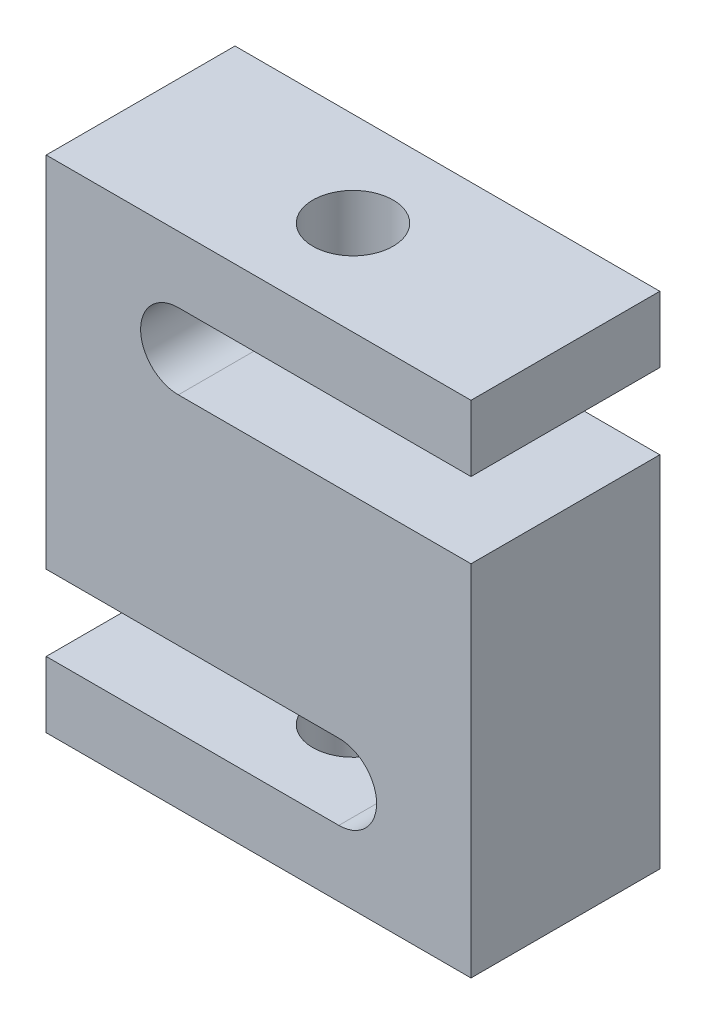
ISO-10303-21;
HEADER;
FILE_DESCRIPTION(('STEP AP214'),'2;1');
FILE_NAME('part.step','',(''),(''),'','','');
FILE_SCHEMA(('AUTOMOTIVE_DESIGN { 1 0 10303 214 1 1 1 1 }'));
ENDSEC;
DATA;
#1=APPLICATION_CONTEXT('core data for automotive mechanical design processes');
#2=APPLICATION_PROTOCOL_DEFINITION('international standard','automotive_design',2000,#1);
#3=PRODUCT_CONTEXT('',#1,'mechanical');
#4=PRODUCT('Part','Part','',(#3));
#5=PRODUCT_RELATED_PRODUCT_CATEGORY('part','',(#4));
#6=PRODUCT_DEFINITION_FORMATION('','',#4);
#7=PRODUCT_DEFINITION_CONTEXT('part definition',#1,'design');
#8=PRODUCT_DEFINITION('design','',#6,#7);
#9=PRODUCT_DEFINITION_SHAPE('','',#8);
#10=(LENGTH_UNIT() NAMED_UNIT(*) SI_UNIT(.MILLI.,.METRE.));
#11=(NAMED_UNIT(*) PLANE_ANGLE_UNIT() SI_UNIT($,.RADIAN.));
#12=(NAMED_UNIT(*) SI_UNIT($,.STERADIAN.) SOLID_ANGLE_UNIT());
#13=UNCERTAINTY_MEASURE_WITH_UNIT(LENGTH_MEASURE(1.E-05),#10,'distance_accuracy_value','');
#14=(GEOMETRIC_REPRESENTATION_CONTEXT(3) GLOBAL_UNCERTAINTY_ASSIGNED_CONTEXT((#13)) GLOBAL_UNIT_ASSIGNED_CONTEXT((#10,
#11,#12)) REPRESENTATION_CONTEXT('',''));
#15=CARTESIAN_POINT('',(0.,0.,0.));
#16=DIRECTION('',(0.,0.,1.));
#17=DIRECTION('',(1.,0.,0.));
#18=AXIS2_PLACEMENT_3D('',#15,#16,#17);
#19=CARTESIAN_POINT('',(-22.5,-26.5,10.));
#20=DIRECTION('',(0.,1.,0.));
#21=DIRECTION('',(0.,0.,1.));
#22=AXIS2_PLACEMENT_3D('',#19,#20,#21);
#23=PLANE('',#22);
#24=DIRECTION('',(1.,0.,0.));
#25=VECTOR('',#24,1.);
#26=CARTESIAN_POINT('',(-22.5,-26.5,-10.));
#27=LINE('',#26,#25);
#28=CARTESIAN_POINT('',(-22.5,-26.5,-10.));
#29=VERTEX_POINT('',#28);
#30=CARTESIAN_POINT('',(22.5,-26.5,-10.));
#31=VERTEX_POINT('',#30);
#32=EDGE_CURVE('E518',#29,#31,#27,.T.);
#33=ORIENTED_EDGE('',*,*,#32,.T.);
#34=DIRECTION('',(0.,0.,-1.));
#35=VECTOR('',#34,1.);
#36=CARTESIAN_POINT('',(22.5,-26.5,10.));
#37=LINE('',#36,#35);
#38=CARTESIAN_POINT('',(22.5,-26.5,10.));
#39=VERTEX_POINT('',#38);
#40=EDGE_CURVE('E542',#39,#31,#37,.T.);
#41=ORIENTED_EDGE('',*,*,#40,.F.);
#42=DIRECTION('',(1.,0.,0.));
#43=VECTOR('',#42,1.);
#44=CARTESIAN_POINT('',(-22.5,-26.5,10.));
#45=LINE('',#44,#43);
#46=CARTESIAN_POINT('',(-22.5,-26.5,10.));
#47=VERTEX_POINT('',#46);
#48=EDGE_CURVE('E528',#47,#39,#45,.T.);
#49=ORIENTED_EDGE('',*,*,#48,.F.);
#50=DIRECTION('',(0.,0.,-1.));
#51=VECTOR('',#50,1.);
#52=CARTESIAN_POINT('',(-22.5,-26.5,10.));
#53=LINE('',#52,#51);
#54=EDGE_CURVE('E545',#47,#29,#53,.T.);
#55=ORIENTED_EDGE('',*,*,#54,.T.);
#56=EDGE_LOOP('',(#33,#41,#49,#55));
#57=FACE_BOUND('',#56,.T.);
#58=CARTESIAN_POINT('',(0.,-26.5,0.));
#59=DIRECTION('',(0.,-1.,0.));
#60=DIRECTION('',(0.,0.,-1.));
#61=AXIS2_PLACEMENT_3D('',#58,#59,#60);
#62=CIRCLE('',#61,4.24999999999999);
#63=CARTESIAN_POINT('',(0.,-26.5,-4.24999999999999));
#64=VERTEX_POINT('',#63);
#65=EDGE_CURVE('E598',#64,#64,#62,.T.);
#66=ORIENTED_EDGE('',*,*,#65,.F.);
#67=EDGE_LOOP('',(#66));
#68=FACE_BOUND('',#67,.T.);
#69=ADVANCED_FACE('F369',(#57,#68),#23,.F.);
#70=CARTESIAN_POINT('',(-22.5,26.5,10.));
#71=DIRECTION('',(0.,-1.,0.));
#72=DIRECTION('',(0.,0.,-1.));
#73=AXIS2_PLACEMENT_3D('',#70,#71,#72);
#74=PLANE('',#73);
#75=DIRECTION('',(-1.,0.,0.));
#76=VECTOR('',#75,1.);
#77=CARTESIAN_POINT('',(-22.5,26.5,-10.));
#78=LINE('',#77,#76);
#79=CARTESIAN_POINT('',(22.5,26.5,-10.));
#80=VERTEX_POINT('',#79);
#81=CARTESIAN_POINT('',(-22.5,26.5,-10.));
#82=VERTEX_POINT('',#81);
#83=EDGE_CURVE('E524',#80,#82,#78,.T.);
#84=ORIENTED_EDGE('',*,*,#83,.T.);
#85=DIRECTION('',(0.,0.,-1.));
#86=VECTOR('',#85,1.);
#87=CARTESIAN_POINT('',(-22.5,26.5,10.));
#88=LINE('',#87,#86);
#89=CARTESIAN_POINT('',(-22.5,26.5,10.));
#90=VERTEX_POINT('',#89);
#91=EDGE_CURVE('E536',#90,#82,#88,.T.);
#92=ORIENTED_EDGE('',*,*,#91,.F.);
#93=DIRECTION('',(-1.,0.,0.));
#94=VECTOR('',#93,1.);
#95=CARTESIAN_POINT('',(-22.5,26.5,10.));
#96=LINE('',#95,#94);
#97=CARTESIAN_POINT('',(22.5,26.5,10.));
#98=VERTEX_POINT('',#97);
#99=EDGE_CURVE('E534',#98,#90,#96,.T.);
#100=ORIENTED_EDGE('',*,*,#99,.F.);
#101=DIRECTION('',(0.,0.,-1.));
#102=VECTOR('',#101,1.);
#103=CARTESIAN_POINT('',(22.5,26.5,10.));
#104=LINE('',#103,#102);
#105=EDGE_CURVE('E539',#98,#80,#104,.T.);
#106=ORIENTED_EDGE('',*,*,#105,.T.);
#107=EDGE_LOOP('',(#84,#92,#100,#106));
#108=FACE_BOUND('',#107,.T.);
#109=CARTESIAN_POINT('',(0.,26.5,0.));
#110=DIRECTION('',(0.,1.,0.));
#111=DIRECTION('',(0.,0.,1.));
#112=AXIS2_PLACEMENT_3D('',#109,#110,#111);
#113=CIRCLE('',#112,4.24999999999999);
#114=CARTESIAN_POINT('',(0.,26.5,4.24999999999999));
#115=VERTEX_POINT('',#114);
#116=EDGE_CURVE('E592',#115,#115,#113,.T.);
#117=ORIENTED_EDGE('',*,*,#116,.F.);
#118=EDGE_LOOP('',(#117));
#119=FACE_BOUND('',#118,.T.);
#120=ADVANCED_FACE('F586',(#108,#119),#74,.F.);
#121=CARTESIAN_POINT('',(-22.5,26.5,10.));
#122=DIRECTION('',(1.,0.,0.));
#123=DIRECTION('',(0.,1.,0.));
#124=AXIS2_PLACEMENT_3D('',#121,#122,#123);
#125=PLANE('',#124);
#126=DIRECTION('',(0.,-1.,0.));
#127=VECTOR('',#126,1.);
#128=CARTESIAN_POINT('',(-22.5,26.5,10.));
#129=LINE('',#128,#127);
#130=CARTESIAN_POINT('',(-22.5,-19.5,10.));
#131=VERTEX_POINT('',#130);
#132=EDGE_CURVE('E526',#131,#47,#129,.T.);
#133=ORIENTED_EDGE('',*,*,#132,.F.);
#134=DIRECTION('',(0.,0.,-1.));
#135=VECTOR('',#134,1.);
#136=CARTESIAN_POINT('',(-22.5,-19.5,10.));
#137=LINE('',#136,#135);
#138=CARTESIAN_POINT('',(-22.5,-19.5,-10.));
#139=VERTEX_POINT('',#138);
#140=EDGE_CURVE('E490',#131,#139,#137,.T.);
#141=ORIENTED_EDGE('',*,*,#140,.T.);
#142=DIRECTION('',(0.,-1.,0.));
#143=VECTOR('',#142,1.);
#144=CARTESIAN_POINT('',(-22.5,26.5,-10.));
#145=LINE('',#144,#143);
#146=EDGE_CURVE('E514',#139,#29,#145,.T.);
#147=ORIENTED_EDGE('',*,*,#146,.T.);
#148=ORIENTED_EDGE('',*,*,#54,.F.);
#149=EDGE_LOOP('',(#133,#141,#147,#148));
#150=FACE_BOUND('',#149,.T.);
#151=ADVANCED_FACE('F580',(#150),#125,.F.);
#152=CARTESIAN_POINT('',(22.5,26.5,10.));
#153=DIRECTION('',(-1.,0.,0.));
#154=DIRECTION('',(0.,-1.,0.));
#155=AXIS2_PLACEMENT_3D('',#152,#153,#154);
#156=PLANE('',#155);
#157=DIRECTION('',(0.,1.,0.));
#158=VECTOR('',#157,1.);
#159=CARTESIAN_POINT('',(22.5,26.5,10.));
#160=LINE('',#159,#158);
#161=CARTESIAN_POINT('',(22.5,19.5,10.));
#162=VERTEX_POINT('',#161);
#163=EDGE_CURVE('E530',#162,#98,#160,.T.);
#164=ORIENTED_EDGE('',*,*,#163,.F.);
#165=DIRECTION('',(0.,0.,-1.));
#166=VECTOR('',#165,1.);
#167=CARTESIAN_POINT('',(22.5,19.5,10.));
#168=LINE('',#167,#166);
#169=CARTESIAN_POINT('',(22.5,19.5,-10.));
#170=VERTEX_POINT('',#169);
#171=EDGE_CURVE('E511',#162,#170,#168,.T.);
#172=ORIENTED_EDGE('',*,*,#171,.T.);
#173=DIRECTION('',(0.,1.,0.));
#174=VECTOR('',#173,1.);
#175=CARTESIAN_POINT('',(22.5,26.5,-10.));
#176=LINE('',#175,#174);
#177=EDGE_CURVE('E520',#170,#80,#176,.T.);
#178=ORIENTED_EDGE('',*,*,#177,.T.);
#179=ORIENTED_EDGE('',*,*,#105,.F.);
#180=EDGE_LOOP('',(#164,#172,#178,#179));
#181=FACE_BOUND('',#180,.T.);
#182=ADVANCED_FACE('F559',(#181),#156,.F.);
#183=CARTESIAN_POINT('',(-22.5,-11.5,-10.));
#184=VERTEX_POINT('',#183);
#185=EDGE_CURVE('E515',#82,#184,#145,.T.);
#186=ORIENTED_EDGE('',*,*,#185,.T.);
#187=DIRECTION('',(0.,0.,1.));
#188=VECTOR('',#187,1.);
#189=CARTESIAN_POINT('',(-22.5,-11.5,10.));
#190=LINE('',#189,#188);
#191=CARTESIAN_POINT('',(-22.5,-11.5,10.));
#192=VERTEX_POINT('',#191);
#193=EDGE_CURVE('E384',#184,#192,#190,.T.);
#194=ORIENTED_EDGE('',*,*,#193,.T.);
#195=EDGE_CURVE('E479',#90,#192,#129,.T.);
#196=ORIENTED_EDGE('',*,*,#195,.F.);
#197=ORIENTED_EDGE('',*,*,#91,.T.);
#198=EDGE_LOOP('',(#186,#194,#196,#197));
#199=FACE_BOUND('',#198,.T.);
#200=ADVANCED_FACE('F371',(#199),#125,.F.);
#201=CARTESIAN_POINT('',(22.5,11.5,-10.));
#202=VERTEX_POINT('',#201);
#203=EDGE_CURVE('E521',#31,#202,#176,.T.);
#204=ORIENTED_EDGE('',*,*,#203,.T.);
#205=DIRECTION('',(0.,0.,1.));
#206=VECTOR('',#205,1.);
#207=CARTESIAN_POINT('',(22.5,11.5,10.));
#208=LINE('',#207,#206);
#209=CARTESIAN_POINT('',(22.5,11.5,10.));
#210=VERTEX_POINT('',#209);
#211=EDGE_CURVE('E392',#202,#210,#208,.T.);
#212=ORIENTED_EDGE('',*,*,#211,.T.);
#213=EDGE_CURVE('E531',#39,#210,#160,.T.);
#214=ORIENTED_EDGE('',*,*,#213,.F.);
#215=ORIENTED_EDGE('',*,*,#40,.T.);
#216=EDGE_LOOP('',(#204,#212,#214,#215));
#217=FACE_BOUND('',#216,.T.);
#218=ADVANCED_FACE('F571',(#217),#156,.F.);
#219=CARTESIAN_POINT('',(-22.5,-26.5,10.));
#220=DIRECTION('',(0.,0.,1.));
#221=DIRECTION('',(1.,0.,0.));
#222=AXIS2_PLACEMENT_3D('',#219,#220,#221);
#223=PLANE('',#222);
#224=DIRECTION('',(1.,0.,0.));
#225=VECTOR('',#224,1.);
#226=CARTESIAN_POINT('',(8.5,-19.5,10.));
#227=LINE('',#226,#225);
#228=CARTESIAN_POINT('',(8.5,-19.5,10.));
#229=VERTEX_POINT('',#228);
#230=EDGE_CURVE('E480',#131,#229,#227,.T.);
#231=ORIENTED_EDGE('',*,*,#230,.F.);
#232=ORIENTED_EDGE('',*,*,#132,.T.);
#233=ORIENTED_EDGE('',*,*,#48,.T.);
#234=ORIENTED_EDGE('',*,*,#213,.T.);
#235=DIRECTION('',(1.,0.,0.));
#236=VECTOR('',#235,1.);
#237=CARTESIAN_POINT('',(-8.50000000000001,11.5,10.));
#238=LINE('',#237,#236);
#239=CARTESIAN_POINT('',(-8.50000000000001,11.5,10.));
#240=VERTEX_POINT('',#239);
#241=EDGE_CURVE('E496',#240,#210,#238,.T.);
#242=ORIENTED_EDGE('',*,*,#241,.F.);
#243=CARTESIAN_POINT('',(-8.50000000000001,15.5,10.));
#244=DIRECTION('',(0.,0.,1.));
#245=DIRECTION('',(1.,0.,0.));
#246=AXIS2_PLACEMENT_3D('',#243,#244,#245);
#247=CIRCLE('',#246,4.);
#248=CARTESIAN_POINT('',(-8.50000000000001,19.5,10.));
#249=VERTEX_POINT('',#248);
#250=EDGE_CURVE('E493',#249,#240,#247,.T.);
#251=ORIENTED_EDGE('',*,*,#250,.F.);
#252=DIRECTION('',(-1.,0.,0.));
#253=VECTOR('',#252,1.);
#254=CARTESIAN_POINT('',(-8.50000000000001,19.5,10.));
#255=LINE('',#254,#253);
#256=EDGE_CURVE('E498',#162,#249,#255,.T.);
#257=ORIENTED_EDGE('',*,*,#256,.F.);
#258=ORIENTED_EDGE('',*,*,#163,.T.);
#259=ORIENTED_EDGE('',*,*,#99,.T.);
#260=ORIENTED_EDGE('',*,*,#195,.T.);
#261=DIRECTION('',(-1.,0.,0.));
#262=VECTOR('',#261,1.);
#263=CARTESIAN_POINT('',(8.5,-11.5,10.));
#264=LINE('',#263,#262);
#265=CARTESIAN_POINT('',(8.5,-11.5,10.));
#266=VERTEX_POINT('',#265);
#267=EDGE_CURVE('E461',#266,#192,#264,.T.);
#268=ORIENTED_EDGE('',*,*,#267,.F.);
#269=CARTESIAN_POINT('',(8.5,-15.5,10.));
#270=DIRECTION('',(0.,0.,1.));
#271=DIRECTION('',(1.,0.,0.));
#272=AXIS2_PLACEMENT_3D('',#269,#270,#271);
#273=CIRCLE('',#272,4.);
#274=EDGE_CURVE('E470',#229,#266,#273,.T.);
#275=ORIENTED_EDGE('',*,*,#274,.F.);
#276=EDGE_LOOP('',(#231,#232,#233,#234,#242,#251,#257,#258,#259,#260,#268,#275));
#277=FACE_BOUND('',#276,.T.);
#278=ADVANCED_FACE('F477',(#277),#223,.T.);
#279=CARTESIAN_POINT('',(-22.5,-26.5,-10.));
#280=DIRECTION('',(0.,0.,1.));
#281=DIRECTION('',(1.,0.,0.));
#282=AXIS2_PLACEMENT_3D('',#279,#280,#281);
#283=PLANE('',#282);
#284=ORIENTED_EDGE('',*,*,#146,.F.);
#285=DIRECTION('',(1.,0.,0.));
#286=VECTOR('',#285,1.);
#287=CARTESIAN_POINT('',(-22.5,-19.5,-10.));
#288=LINE('',#287,#286);
#289=CARTESIAN_POINT('',(8.5,-19.5,-10.));
#290=VERTEX_POINT('',#289);
#291=EDGE_CURVE('E11',#139,#290,#288,.T.);
#292=ORIENTED_EDGE('',*,*,#291,.T.);
#293=CARTESIAN_POINT('',(8.5,-15.5,-10.));
#294=DIRECTION('',(0.,0.,1.));
#295=DIRECTION('',(1.,0.,0.));
#296=AXIS2_PLACEMENT_3D('',#293,#294,#295);
#297=CIRCLE('',#296,4.);
#298=CARTESIAN_POINT('',(8.5,-11.5,-10.));
#299=VERTEX_POINT('',#298);
#300=EDGE_CURVE('E482',#290,#299,#297,.T.);
#301=ORIENTED_EDGE('',*,*,#300,.T.);
#302=DIRECTION('',(-1.,0.,0.));
#303=VECTOR('',#302,1.);
#304=CARTESIAN_POINT('',(8.5,-11.5,-10.));
#305=LINE('',#304,#303);
#306=EDGE_CURVE('E462',#299,#184,#305,.T.);
#307=ORIENTED_EDGE('',*,*,#306,.T.);
#308=ORIENTED_EDGE('',*,*,#185,.F.);
#309=ORIENTED_EDGE('',*,*,#83,.F.);
#310=ORIENTED_EDGE('',*,*,#177,.F.);
#311=DIRECTION('',(-1.,0.,0.));
#312=VECTOR('',#311,1.);
#313=CARTESIAN_POINT('',(-22.5,19.5,-10.));
#314=LINE('',#313,#312);
#315=CARTESIAN_POINT('',(-8.50000000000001,19.5,-10.));
#316=VERTEX_POINT('',#315);
#317=EDGE_CURVE('E377',#170,#316,#314,.T.);
#318=ORIENTED_EDGE('',*,*,#317,.T.);
#319=CARTESIAN_POINT('',(-8.50000000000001,15.5,-10.));
#320=DIRECTION('',(0.,0.,1.));
#321=DIRECTION('',(1.,0.,0.));
#322=AXIS2_PLACEMENT_3D('',#319,#320,#321);
#323=CIRCLE('',#322,4.);
#324=CARTESIAN_POINT('',(-8.50000000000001,11.5,-10.));
#325=VERTEX_POINT('',#324);
#326=EDGE_CURVE('E500',#316,#325,#323,.T.);
#327=ORIENTED_EDGE('',*,*,#326,.T.);
#328=DIRECTION('',(1.,0.,0.));
#329=VECTOR('',#328,1.);
#330=CARTESIAN_POINT('',(-8.50000000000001,11.5,-10.));
#331=LINE('',#330,#329);
#332=EDGE_CURVE('E503',#325,#202,#331,.T.);
#333=ORIENTED_EDGE('',*,*,#332,.T.);
#334=ORIENTED_EDGE('',*,*,#203,.F.);
#335=ORIENTED_EDGE('',*,*,#32,.F.);
#336=EDGE_LOOP('',(#284,#292,#301,#307,#308,#309,#310,#318,#327,#333,#334,#335));
#337=FACE_BOUND('',#336,.T.);
#338=ADVANCED_FACE('F551',(#337),#283,.F.);
#339=CARTESIAN_POINT('',(-8.50000000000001,19.5,-10.));
#340=DIRECTION('',(0.,1.,0.));
#341=DIRECTION('',(0.,0.,1.));
#342=AXIS2_PLACEMENT_3D('',#339,#340,#341);
#343=PLANE('',#342);
#344=CARTESIAN_POINT('',(0.,19.5,0.));
#345=DIRECTION('',(0.,1.,0.));
#346=DIRECTION('',(0.,0.,1.));
#347=AXIS2_PLACEMENT_3D('',#344,#345,#346);
#348=CIRCLE('',#347,4.24999999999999);
#349=CARTESIAN_POINT('',(0.,19.5,4.24999999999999));
#350=VERTEX_POINT('',#349);
#351=EDGE_CURVE('E474',#350,#350,#348,.T.);
#352=ORIENTED_EDGE('',*,*,#351,.T.);
#353=EDGE_LOOP('',(#352));
#354=FACE_BOUND('',#353,.T.);
#355=ORIENTED_EDGE('',*,*,#256,.T.);
#356=DIRECTION('',(0.,0.,1.));
#357=VECTOR('',#356,1.);
#358=CARTESIAN_POINT('',(-8.50000000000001,19.5,-10.));
#359=LINE('',#358,#357);
#360=EDGE_CURVE('E506',#316,#249,#359,.T.);
#361=ORIENTED_EDGE('',*,*,#360,.F.);
#362=ORIENTED_EDGE('',*,*,#317,.F.);
#363=ORIENTED_EDGE('',*,*,#171,.F.);
#364=EDGE_LOOP('',(#355,#361,#362,#363));
#365=FACE_BOUND('',#364,.T.);
#366=ADVANCED_FACE('F555',(#354,#365),#343,.F.);
#367=CARTESIAN_POINT('',(-8.50000000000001,11.5,-10.));
#368=DIRECTION('',(0.,-1.,0.));
#369=DIRECTION('',(0.,0.,-1.));
#370=AXIS2_PLACEMENT_3D('',#367,#368,#369);
#371=PLANE('',#370);
#372=ORIENTED_EDGE('',*,*,#332,.F.);
#373=DIRECTION('',(0.,0.,1.));
#374=VECTOR('',#373,1.);
#375=CARTESIAN_POINT('',(-8.50000000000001,11.5,-10.));
#376=LINE('',#375,#374);
#377=EDGE_CURVE('E505',#325,#240,#376,.T.);
#378=ORIENTED_EDGE('',*,*,#377,.T.);
#379=ORIENTED_EDGE('',*,*,#241,.T.);
#380=ORIENTED_EDGE('',*,*,#211,.F.);
#381=EDGE_LOOP('',(#372,#378,#379,#380));
#382=FACE_BOUND('',#381,.T.);
#383=ADVANCED_FACE('F567',(#382),#371,.F.);
#384=CARTESIAN_POINT('',(-8.50000000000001,15.5,-10.));
#385=DIRECTION('',(0.,0.,1.));
#386=DIRECTION('',(1.,0.,0.));
#387=AXIS2_PLACEMENT_3D('',#384,#385,#386);
#388=CYLINDRICAL_SURFACE('',#387,4.);
#389=ORIENTED_EDGE('',*,*,#250,.T.);
#390=ORIENTED_EDGE('',*,*,#377,.F.);
#391=ORIENTED_EDGE('',*,*,#326,.F.);
#392=ORIENTED_EDGE('',*,*,#360,.T.);
#393=EDGE_LOOP('',(#389,#390,#391,#392));
#394=FACE_BOUND('',#393,.T.);
#395=ADVANCED_FACE('F566',(#394),#388,.F.);
#396=CARTESIAN_POINT('',(8.5,-19.5,-10.));
#397=DIRECTION('',(0.,-1.,0.));
#398=DIRECTION('',(1.,0.,0.));
#399=AXIS2_PLACEMENT_3D('',#396,#397,#398);
#400=PLANE('',#399);
#401=CARTESIAN_POINT('',(0.,-19.5,0.));
#402=DIRECTION('',(0.,-1.,0.));
#403=DIRECTION('',(1.,0.,0.));
#404=AXIS2_PLACEMENT_3D('',#401,#402,#403);
#405=CIRCLE('',#404,4.24999999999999);
#406=CARTESIAN_POINT('',(4.24999999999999,-19.5,0.));
#407=VERTEX_POINT('',#406);
#408=EDGE_CURVE('E594',#407,#407,#405,.T.);
#409=ORIENTED_EDGE('',*,*,#408,.T.);
#410=EDGE_LOOP('',(#409));
#411=FACE_BOUND('',#410,.T.);
#412=ORIENTED_EDGE('',*,*,#230,.T.);
#413=DIRECTION('',(0.,0.,1.));
#414=VECTOR('',#413,1.);
#415=CARTESIAN_POINT('',(8.5,-19.5,-10.));
#416=LINE('',#415,#414);
#417=EDGE_CURVE('E466',#290,#229,#416,.T.);
#418=ORIENTED_EDGE('',*,*,#417,.F.);
#419=ORIENTED_EDGE('',*,*,#291,.F.);
#420=ORIENTED_EDGE('',*,*,#140,.F.);
#421=EDGE_LOOP('',(#412,#418,#419,#420));
#422=FACE_BOUND('',#421,.T.);
#423=ADVANCED_FACE('F582',(#411,#422),#400,.F.);
#424=CARTESIAN_POINT('',(8.5,-11.5,-10.));
#425=DIRECTION('',(0.,1.,0.));
#426=DIRECTION('',(-1.,0.,0.));
#427=AXIS2_PLACEMENT_3D('',#424,#425,#426);
#428=PLANE('',#427);
#429=ORIENTED_EDGE('',*,*,#306,.F.);
#430=DIRECTION('',(0.,0.,1.));
#431=VECTOR('',#430,1.);
#432=CARTESIAN_POINT('',(8.5,-11.5,-10.));
#433=LINE('',#432,#431);
#434=EDGE_CURVE('E457',#299,#266,#433,.T.);
#435=ORIENTED_EDGE('',*,*,#434,.T.);
#436=ORIENTED_EDGE('',*,*,#267,.T.);
#437=ORIENTED_EDGE('',*,*,#193,.F.);
#438=EDGE_LOOP('',(#429,#435,#436,#437));
#439=FACE_BOUND('',#438,.T.);
#440=ADVANCED_FACE('F459',(#439),#428,.F.);
#441=CARTESIAN_POINT('',(8.5,-15.5,-10.));
#442=DIRECTION('',(0.,0.,1.));
#443=DIRECTION('',(1.,0.,0.));
#444=AXIS2_PLACEMENT_3D('',#441,#442,#443);
#445=CYLINDRICAL_SURFACE('',#444,4.);
#446=ORIENTED_EDGE('',*,*,#274,.T.);
#447=ORIENTED_EDGE('',*,*,#434,.F.);
#448=ORIENTED_EDGE('',*,*,#300,.F.);
#449=ORIENTED_EDGE('',*,*,#417,.T.);
#450=EDGE_LOOP('',(#446,#447,#448,#449));
#451=FACE_BOUND('',#450,.T.);
#452=ADVANCED_FACE('F471',(#451),#445,.F.);
#453=CARTESIAN_POINT('',(0.,26.5,0.));
#454=DIRECTION('',(0.,1.,0.));
#455=DIRECTION('',(0.,0.,1.));
#456=AXIS2_PLACEMENT_3D('',#453,#454,#455);
#457=CYLINDRICAL_SURFACE('',#456,4.24999999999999);
#458=ORIENTED_EDGE('',*,*,#351,.F.);
#459=EDGE_LOOP('',(#458));
#460=FACE_BOUND('',#459,.T.);
#461=ORIENTED_EDGE('',*,*,#116,.T.);
#462=EDGE_LOOP('',(#461));
#463=FACE_BOUND('',#462,.T.);
#464=ADVANCED_FACE('F626',(#460,#463),#457,.F.);
#465=CARTESIAN_POINT('',(0.,-26.5,0.));
#466=DIRECTION('',(0.,-1.,0.));
#467=DIRECTION('',(0.,0.,-1.));
#468=AXIS2_PLACEMENT_3D('',#465,#466,#467);
#469=CYLINDRICAL_SURFACE('',#468,4.24999999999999);
#470=ORIENTED_EDGE('',*,*,#408,.F.);
#471=EDGE_LOOP('',(#470));
#472=FACE_BOUND('',#471,.T.);
#473=ORIENTED_EDGE('',*,*,#65,.T.);
#474=EDGE_LOOP('',(#473));
#475=FACE_BOUND('',#474,.T.);
#476=ADVANCED_FACE('F604',(#472,#475),#469,.F.);
#477=CLOSED_SHELL('',(#69,#120,#151,#182,#200,#218,#278,#338,#366,#383,#395,#423,#440,#452,#464,#476));
#478=MANIFOLD_SOLID_BREP('B2',#477);
#479=ADVANCED_BREP_SHAPE_REPRESENTATION('',(#18,#478),#14);
#480=SHAPE_DEFINITION_REPRESENTATION(#9,#479);
ENDSEC;
END-ISO-10303-21;
